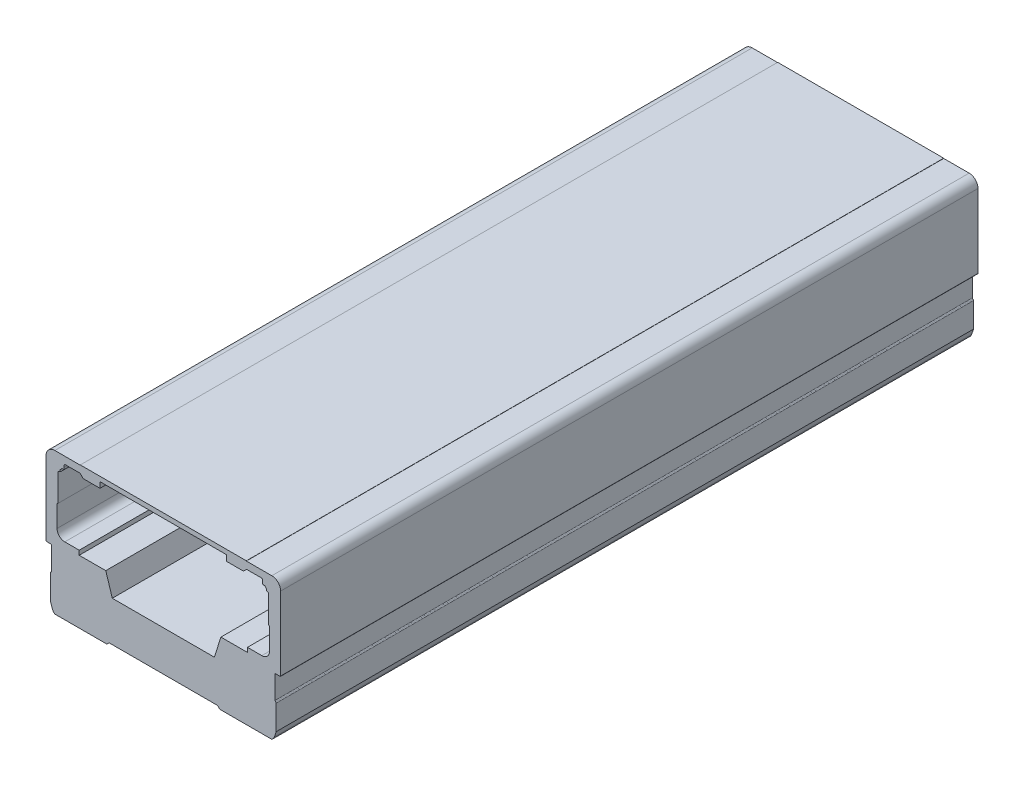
from build123d import *

# Parameters (mm, degrees)
EXTRUDE_1_DEPTH        = 315
HOLE_WIZARD_M5_1_D     = 4.2
HOLE_WIZARD_M5_1_DEPTH = 11.4
HOLE_WIZARD_M5_1_TIP   = 1.2618073


with BuildPart() as part:
    # Sketch 1 → Extrude 1 (new body)
    with BuildSketch(Plane.XY):
        with BuildLine():
            Line((37.5, 44.837148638), (37.5, 44.937148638))
            Line((37.5, 44.937148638), (-37.5, 44.937148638))
            Line((-37.5, 44.937148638), (-37.5, 44.837148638))
            Line((-37.5, 44.837148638), (-49, 44.837148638))
            ThreePointArc((-49, 44.837148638), (-51.828427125, 43.665575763), (-53, 40.837148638))
            Line((-53, 40.837148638), (-53, 7.637148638))
            ThreePointArc((-53, 7.637148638), (-52.912132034, 7.425016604), (-52.7, 7.337148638))
            Line((-52.7, 7.337148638), (-50.5, 7.337148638))
            Line((-50.5, 7.337148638), (-50.5, -3.162851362))
            ThreePointArc((-50.5, -3.162851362), (-50.566987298, -3.412851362), (-50.75, -3.595864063))
            ThreePointArc((-50.75, -3.595864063), (-50.933012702, -3.778876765), (-51, -4.028876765))
            Line((-51, -4.028876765), (-51, -15.162851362))
            Line((-51, -15.162851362), (-50.137801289, -17.666858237))
            ThreePointArc((-50.137801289, -17.666858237), (-49.689081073, -18.50625993), (-49, -19.162851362))
            Line((-49, -19.162851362), (-25.5, -19.162851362))
            Line((-25.5, -19.162851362), (-24.5, -18.162851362))
            Line((-24.5, -18.162851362), (24.5, -18.162851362))
            Line((24.5, -18.162851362), (25.5, -19.162851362))
            Line((25.5, -19.162851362), (49, -19.162851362))
            ThreePointArc((49, -19.162851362), (49.687879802, -18.507838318), (50.136507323, -17.670608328))
            Line((50.136507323, -17.670608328), (50.999999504, -15.162850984))
            Line((50.999999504, -15.162850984), (50.999999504, -4.028876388))
            ThreePointArc((50.999999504, -4.028876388), (50.933012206, -3.778876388), (50.749999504, -3.595863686))
            ThreePointArc((50.749999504, -3.595863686), (50.566986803, -3.412850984), (50.499999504, -3.162850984))
            Line((50.499999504, -3.162850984), (50.499999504, 7.337148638))
            Line((50.499999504, 7.337148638), (52.7, 7.337148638))
            ThreePointArc((52.7, 7.337148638), (52.912132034, 7.425016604), (53, 7.637148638))
            Line((53, 7.637148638), (53, 40.837148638))
            ThreePointArc((53, 40.837148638), (51.828427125, 43.665575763), (49, 44.837148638))
            Line((49, 44.837148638), (37.5, 44.837148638))
        make_face()
        with BuildLine():
            Line((-47.6, 24.837148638), (-48, 24.537148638))
            Line((-48, 24.537148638), (-48, 14.837148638))
            ThreePointArc((-48, 14.837148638), (-46.974873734, 12.362274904), (-44.5, 11.337148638))
            Line((-44.5, 11.337148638), (-38, 11.337148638))
            Line((-38, 11.337148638), (-38, 9.337148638))
            Line((-38, 9.337148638), (-26, 9.337148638))
            Line((-26, 9.337148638), (-23.056008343, 0))
            Line((-23.056008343, 0), (23.056008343, 0))
            Line((23.056008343, 0), (26, 9.337148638))
            Line((26, 9.337148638), (38, 9.337148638))
            Line((38, 9.337148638), (38, 11.337148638))
            Line((38, 11.337148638), (44.5, 11.337148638))
            ThreePointArc((44.5, 11.337148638), (46.974873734, 12.362274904), (48, 14.837148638))
            Line((48, 14.837148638), (48, 24.537148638))
            Line((48, 24.537148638), (47.6, 24.837148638))
            Line((47.6, 24.837148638), (47.6, 37.075247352))
            ThreePointArc((47.6, 37.075247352), (47.479393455, 37.400916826), (47.175757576, 37.56947482))
            ThreePointArc((47.175757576, 37.56947482), (46.809680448, 37.650999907), (46.45778258, 37.780717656))
            Line((46.45778258, 37.780717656), (46.73829413, 38.532304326))
            ThreePointArc((46.73829413, 38.532304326), (46.185786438, 38.922935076), (45.795155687, 39.475442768))
            Line((45.795155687, 39.475442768), (45.043569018, 39.194931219))
            ThreePointArc((45.043569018, 39.194931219), (44.861569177, 39.753199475), (44.8, 40.337148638))
            Line((44.8, 40.337148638), (44.8, 41.137148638))
            ThreePointArc((44.8, 41.137148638), (44.653553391, 41.490702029), (44.3, 41.637148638))
            Line((44.3, 41.637148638), (37.6, 41.637148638))
            Line((37.6, 41.637148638), (36.2, 40.237148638))
            Line((36.2, 40.237148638), (28.6, 40.237148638))
            Line((28.6, 40.237148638), (28.6, 42.837148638))
            Line((28.6, 42.837148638), (-28.6, 42.837148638))
            Line((-28.6, 42.837148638), (-28.6, 40.237148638))
            Line((-28.6, 40.237148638), (-36.2, 40.237148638))
            Line((-36.2, 40.237148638), (-37.6, 41.637148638))
            Line((-37.6, 41.637148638), (-44.3, 41.637148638))
            ThreePointArc((-44.3, 41.637148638), (-44.653553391, 41.490702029), (-44.8, 41.137148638))
            Line((-44.8, 41.137148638), (-44.8, 40.337148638))
            ThreePointArc((-44.8, 40.337148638), (-44.861569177, 39.753199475), (-45.043569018, 39.194931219))
            Line((-45.043569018, 39.194931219), (-45.795155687, 39.475442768))
            ThreePointArc((-45.795155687, 39.475442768), (-46.185786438, 38.922935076), (-46.73829413, 38.532304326))
            Line((-46.73829413, 38.532304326), (-46.45778258, 37.780717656))
            ThreePointArc((-46.45778258, 37.780717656), (-46.809680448, 37.650999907), (-47.175757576, 37.56947482))
            ThreePointArc((-47.175757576, 37.56947482), (-47.479393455, 37.400916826), (-47.6, 37.075247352))
            Line((-47.6, 37.075247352), (-47.6, 24.837148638))
        make_face(mode=Mode.SUBTRACT)
    extrude(amount=EXTRUDE_1_DEPTH)

    # Hole Wizard M5 _1
    with Locations(Plane(origin=(0, -19.162851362, 0), x_dir=(-1, 0, 0), z_dir=(0, -1, 0))):
        with Locations((42.5, -284.5), (-42.5, -284.5), (42.5, -234.5), (42.5, -34.5), (42.5, 165.5), (42.5, 365.5), (42.5, 565.5), (42.5, 765.5), (-42.5, 565.5), (-42.5, 365.5), (-42.5, 165.5), (-42.5, -34.5), (-42.5, -234.5)):
            Hole(HOLE_WIZARD_M5_1_D / 2, depth=HOLE_WIZARD_M5_1_DEPTH)
            with Locations((0, 0, -(HOLE_WIZARD_M5_1_DEPTH + HOLE_WIZARD_M5_1_TIP / 2))):  # 118° drill point
                Cone(0, HOLE_WIZARD_M5_1_D / 2, HOLE_WIZARD_M5_1_TIP, mode=Mode.SUBTRACT)


solid = part.part
